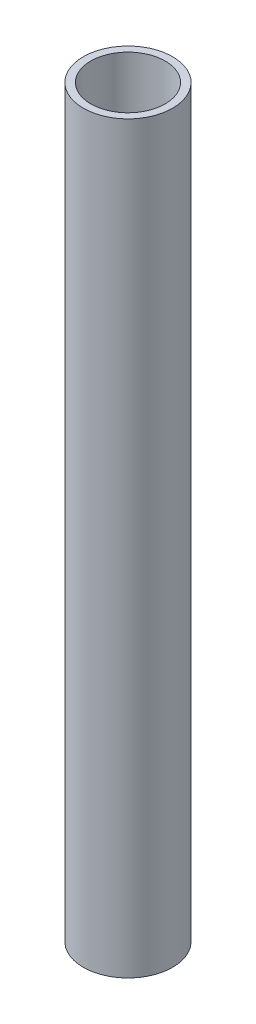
from build123d import *

# Parameters (mm, degrees)
SKETCH2_R           = 30.48
SKETCH2_R_2         = 25.4
BOSS_EXTRUDE1_DEPTH = 508


with BuildPart() as part:
    # Sketch2 → Boss-Extrude1 (new body)
    with BuildSketch(Plane(origin=(0, 0, 0), x_dir=(1, 0, 0), z_dir=(0, 1, 0))):
        with Locations(Location((0, 0, 0), (0, 0, 270))):
            Circle(SKETCH2_R)
        with Locations(Location((0, 0, 0), (0, 0, 270))):
            Circle(SKETCH2_R_2, mode=Mode.SUBTRACT)
    extrude(amount=BOSS_EXTRUDE1_DEPTH)


solid = part.part
